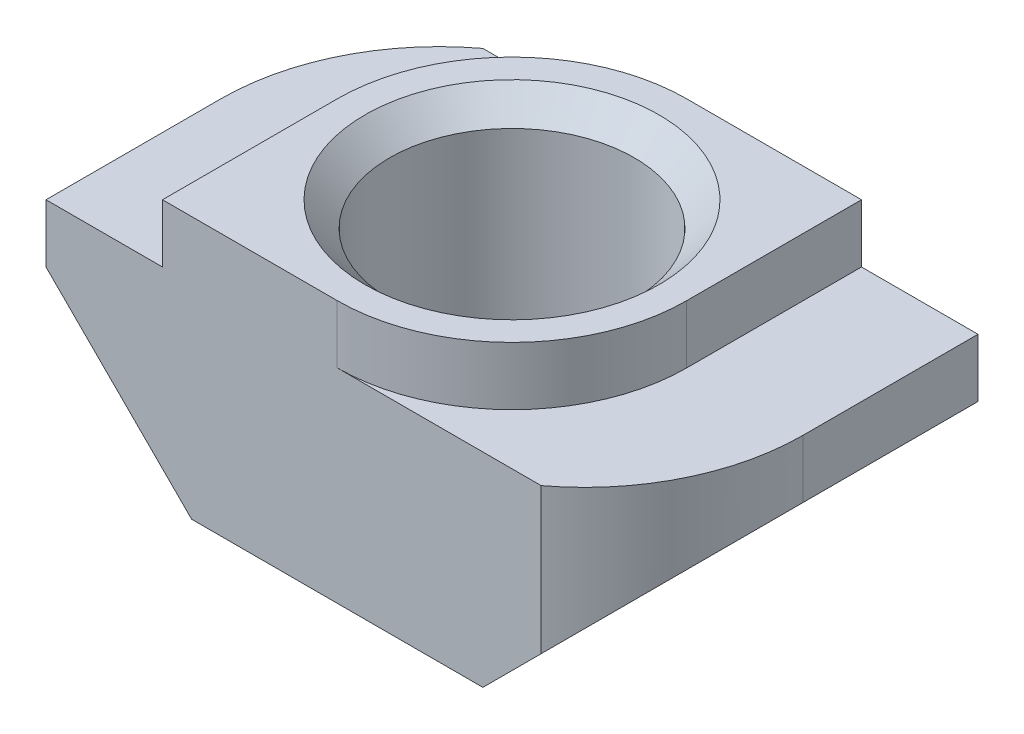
from build123d import *

# Parameters (mm, degrees)
BOSS_EXTRUDE1_DEPTH             = 6
CUT_EXTRUDE1_DEPTH              = 1
CUT_EXTRUDE2_DEPTH              = 9.558621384
M5X0_8_TAPPED_HOLE1_D           = 4.2
M5X0_8_TAPPED_HOLE1_CSINK_D     = 5.05
M5X0_8_TAPPED_HOLE1_CSINK_ANGLE = 90


with BuildPart() as part:
    # Sketch1 → Boss-Extrude1 (new body)
    with BuildSketch(Plane.XY):
        Polygon((-3, 4.5), (3, 4.5), (3, 3.5), (5, 3.5), (5, 2.5), (2.5, 0), (-2.5, 0), (-5, 2.5), (-5, 3.5), (-3, 3.5), align=None)
    extrude(amount=BOSS_EXTRUDE1_DEPTH)

    # Sketch2 → Cut-Extrude1 (cut)
    with BuildSketch(Plane(origin=(0, 4.5, 0), x_dir=(1, 0, 0), z_dir=(0, 1, 0))):
        with BuildLine():
            Line((0, -6), (3, -6))
            Line((3, -6), (3, -3))
            ThreePointArc((3, -3), (2.121320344, -5.121320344), (0, -6))
        make_face()
        with BuildLine():
            Line((0, 0), (-3, 0))
            Line((-3, 0), (-3, -3))
            ThreePointArc((-3, -3), (-2.121320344, -0.878679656), (0, 0))
        make_face()
    extrude(amount=-CUT_EXTRUDE1_DEPTH, mode=Mode.SUBTRACT)

    # Sketch3 → Cut-Extrude2 (cut, through all)
    with BuildSketch(Plane(origin=(0, 3.5, 0), x_dir=(1, 0, 0), z_dir=(0, 1, 0))):
        with BuildLine():
            Line((5, -3), (5, -6))
            Line((5, -6), (3.5, -6))
            ThreePointArc((3.5, -6), (4.604101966, -4.677050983), (5, -3))
        make_face()
        with BuildLine():
            Line((-5, 0), (-3.5, 0))
            ThreePointArc((-3.5, 0), (-4.604101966, -1.322949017), (-5, -3))
            Line((-5, -3), (-5, 0))
        make_face()
    extrude(amount=-CUT_EXTRUDE2_DEPTH, mode=Mode.SUBTRACT)

    # M5x0.8 Tapped Hole1 (through all)
    with Locations(Plane(origin=(0, 4.5, 0), x_dir=(1, 0, 0), z_dir=(0, 1, 0))):
        with Locations((0, -3)):
            CounterSinkHole(M5X0_8_TAPPED_HOLE1_D / 2, M5X0_8_TAPPED_HOLE1_CSINK_D / 2, counter_sink_angle=M5X0_8_TAPPED_HOLE1_CSINK_ANGLE)


solid = part.part
